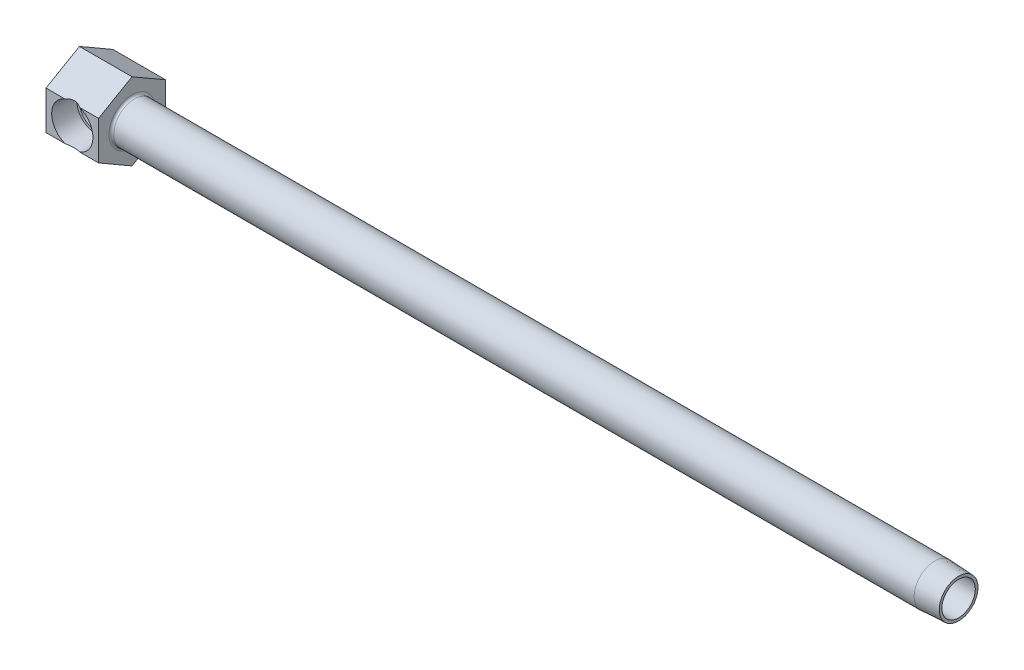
ISO-10303-21;
HEADER;
FILE_DESCRIPTION(('STEP AP214'),'2;1');
FILE_NAME('part.step','',(''),(''),'','','');
FILE_SCHEMA(('AUTOMOTIVE_DESIGN { 1 0 10303 214 1 1 1 1 }'));
ENDSEC;
DATA;
#1=APPLICATION_CONTEXT('core data for automotive mechanical design processes');
#2=APPLICATION_PROTOCOL_DEFINITION('international standard','automotive_design',2000,#1);
#3=PRODUCT_CONTEXT('',#1,'mechanical');
#4=PRODUCT('Part','Part','',(#3));
#5=PRODUCT_RELATED_PRODUCT_CATEGORY('part','',(#4));
#6=PRODUCT_DEFINITION_FORMATION('','',#4);
#7=PRODUCT_DEFINITION_CONTEXT('part definition',#1,'design');
#8=PRODUCT_DEFINITION('design','',#6,#7);
#9=PRODUCT_DEFINITION_SHAPE('','',#8);
#10=(LENGTH_UNIT() NAMED_UNIT(*) SI_UNIT(.MILLI.,.METRE.));
#11=(NAMED_UNIT(*) PLANE_ANGLE_UNIT() SI_UNIT($,.RADIAN.));
#12=(NAMED_UNIT(*) SI_UNIT($,.STERADIAN.) SOLID_ANGLE_UNIT());
#13=UNCERTAINTY_MEASURE_WITH_UNIT(LENGTH_MEASURE(1.E-05),#10,'distance_accuracy_value','');
#14=(GEOMETRIC_REPRESENTATION_CONTEXT(3) GLOBAL_UNCERTAINTY_ASSIGNED_CONTEXT((#13)) GLOBAL_UNIT_ASSIGNED_CONTEXT((#10,
#11,#12)) REPRESENTATION_CONTEXT('',''));
#15=CARTESIAN_POINT('',(0.,0.,0.));
#16=DIRECTION('',(0.,0.,1.));
#17=DIRECTION('',(1.,0.,0.));
#18=AXIS2_PLACEMENT_3D('',#15,#16,#17);
#19=CARTESIAN_POINT('',(63.5,0.,11.1125));
#20=DIRECTION('',(-1.,0.,0.));
#21=DIRECTION('',(0.,0.,1.));
#22=AXIS2_PLACEMENT_3D('',#19,#20,#21);
#23=CYLINDRICAL_SURFACE('',#22,6.858);
#24=CARTESIAN_POINT('',(18.2499,0.,11.1125));
#25=DIRECTION('',(-1.,0.,0.));
#26=DIRECTION('',(0.,-1.,0.));
#27=AXIS2_PLACEMENT_3D('',#24,#25,#26);
#28=CIRCLE('',#27,6.858);
#29=CARTESIAN_POINT('',(18.2499,-6.858,11.1125));
#30=VERTEX_POINT('',#29);
#31=EDGE_CURVE('E22',#30,#30,#28,.F.);
#32=ORIENTED_EDGE('',*,*,#31,.T.);
#33=EDGE_LOOP('',(#32));
#34=FACE_BOUND('',#33,.T.);
#35=CARTESIAN_POINT('',(284.1752,0.,11.1125));
#36=DIRECTION('',(1.,0.,0.));
#37=DIRECTION('',(0.,0.,-1.));
#38=AXIS2_PLACEMENT_3D('',#35,#36,#37);
#39=CIRCLE('',#38,6.858);
#40=CARTESIAN_POINT('',(284.1752,0.,4.2545));
#41=VERTEX_POINT('',#40);
#42=EDGE_CURVE('E156',#41,#41,#39,.T.);
#43=ORIENTED_EDGE('',*,*,#42,.F.);
#44=EDGE_LOOP('',(#43));
#45=FACE_BOUND('',#44,.T.);
#46=ADVANCED_FACE('F15',(#34,#45),#23,.T.);
#47=CARTESIAN_POINT('',(8.7376,0.,22.225));
#48=DIRECTION('',(0.,0.,1.));
#49=DIRECTION('',(1.,0.,0.));
#50=AXIS2_PLACEMENT_3D('',#47,#48,#49);
#51=CONICAL_SURFACE('',#50,6.858,0.0523598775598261);
#52=CARTESIAN_POINT('',(8.7376,-0.680996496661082,34.5170205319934));
#53=DIRECTION('',(0.,-0.866025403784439,-0.5));
#54=DIRECTION('',(0.,-0.5,0.866025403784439));
#55=AXIS2_PLACEMENT_3D('',#52,#53,#54);
#56=ELLIPSE('',#55,15.0043949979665,7.47122554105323);
#57=CARTESIAN_POINT('',(11.1603281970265,6.4158048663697,22.225));
#58=VERTEX_POINT('',#57);
#59=CARTESIAN_POINT('',(6.3148718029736,6.4158048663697,22.225));
#60=VERTEX_POINT('',#59);
#61=EDGE_CURVE('E232',#58,#60,#56,.F.);
#62=ORIENTED_EDGE('',*,*,#61,.T.);
#63=CARTESIAN_POINT('',(8.7376,0.,22.225));
#64=DIRECTION('',(0.,0.,-1.));
#65=DIRECTION('',(-1.,0.,0.));
#66=AXIS2_PLACEMENT_3D('',#63,#64,#65);
#67=CIRCLE('',#66,6.858);
#68=CARTESIAN_POINT('',(6.31487180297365,-6.41580486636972,22.225));
#69=VERTEX_POINT('',#68);
#70=EDGE_CURVE('E36',#69,#60,#67,.T.);
#71=ORIENTED_EDGE('',*,*,#70,.F.);
#72=CARTESIAN_POINT('',(8.7376,0.680996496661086,34.5170205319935));
#73=DIRECTION('',(0.,0.866025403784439,-0.5));
#74=DIRECTION('',(0.,0.5,0.866025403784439));
#75=AXIS2_PLACEMENT_3D('',#72,#73,#74);
#76=ELLIPSE('',#75,15.0043949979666,7.47122554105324);
#77=CARTESIAN_POINT('',(11.1603281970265,-6.4158048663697,22.225));
#78=VERTEX_POINT('',#77);
#79=EDGE_CURVE('E10',#69,#78,#76,.F.);
#80=ORIENTED_EDGE('',*,*,#79,.T.);
#81=EDGE_CURVE('E249',#58,#78,#67,.T.);
#82=ORIENTED_EDGE('',*,*,#81,.F.);
#83=EDGE_LOOP('',(#62,#71,#80,#82));
#84=FACE_BOUND('',#83,.T.);
#85=CARTESIAN_POINT('',(8.7376,0.,14.3002));
#86=DIRECTION('',(0.,0.,-1.));
#87=DIRECTION('',(-1.,0.,0.));
#88=AXIS2_PLACEMENT_3D('',#85,#86,#87);
#89=CIRCLE('',#88,6.44267883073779);
#90=CARTESIAN_POINT('',(13.3057672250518,-4.54312213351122,14.3002));
#91=VERTEX_POINT('',#90);
#92=CARTESIAN_POINT('',(13.3057672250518,4.54312213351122,14.3002));
#93=VERTEX_POINT('',#92);
#94=EDGE_CURVE('E251',#91,#93,#89,.T.);
#95=ORIENTED_EDGE('',*,*,#94,.T.);
#96=CARTESIAN_POINT('',(13.3056128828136,4.54326245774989,14.3));
#97=CARTESIAN_POINT('',(13.4050037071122,4.45290836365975,14.4287190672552));
#98=CARTESIAN_POINT('',(13.5038252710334,4.35690222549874,14.5539811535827));
#99=CARTESIAN_POINT('',(13.6989301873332,4.15324987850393,14.7972290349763));
#100=CARTESIAN_POINT('',(13.7952093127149,4.04558563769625,14.9152031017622));
#101=CARTESIAN_POINT('',(13.9843700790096,3.81752411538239,15.1441485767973));
#102=CARTESIAN_POINT('',(14.0772125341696,3.69701926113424,15.25504596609));
#103=CARTESIAN_POINT('',(14.2568464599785,3.44414434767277,15.4675620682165));
#104=CARTESIAN_POINT('',(14.3436418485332,3.31178210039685,15.5691868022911));
#105=CARTESIAN_POINT('',(14.5527686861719,2.962976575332,15.8122617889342));
#106=CARTESIAN_POINT('',(14.6701286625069,2.73858307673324,15.9469651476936));
#107=CARTESIAN_POINT('',(14.8276174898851,2.38307262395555,16.1264780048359));
#108=CARTESIAN_POINT('',(14.8769849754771,2.2615363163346,16.1825173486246));
#109=CARTESIAN_POINT('',(14.9687772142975,2.0125151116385,16.2864098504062));
#110=CARTESIAN_POINT('',(15.0112056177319,1.88503338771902,16.3342673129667));
#111=CARTESIAN_POINT('',(15.088733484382,1.6232487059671,16.4215218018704));
#112=CARTESIAN_POINT('',(15.1237419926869,1.48888366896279,16.4608139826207));
#113=CARTESIAN_POINT('',(15.1849785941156,1.21573970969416,16.5294343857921));
#114=CARTESIAN_POINT('',(15.2112114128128,1.0769632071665,16.5587679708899));
#115=CARTESIAN_POINT('',(15.2542466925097,0.796159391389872,16.6068431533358));
#116=CARTESIAN_POINT('',(15.2710505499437,0.654132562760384,16.6255863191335));
#117=CARTESIAN_POINT('',(15.2947665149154,0.368243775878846,16.6520290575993));
#118=CARTESIAN_POINT('',(15.3016803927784,0.22438215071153,16.6597306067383));
#119=CARTESIAN_POINT('',(15.3051381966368,-0.0413792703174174,16.6635827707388));
#120=CARTESIAN_POINT('',(15.3031178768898,-0.163241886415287,16.6613326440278));
#121=CARTESIAN_POINT('',(15.2919140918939,-0.406265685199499,16.6488476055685));
#122=CARTESIAN_POINT('',(15.282728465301,-0.527426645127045,16.6386102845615));
#123=CARTESIAN_POINT('',(15.2573805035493,-0.768029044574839,16.6103343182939));
#124=CARTESIAN_POINT('',(15.2412218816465,-0.88747136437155,16.5922998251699));
#125=CARTESIAN_POINT('',(15.2022471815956,-1.1238947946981,16.5487418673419));
#126=CARTESIAN_POINT('',(15.1794285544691,-1.24087494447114,16.5232155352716));
#127=CARTESIAN_POINT('',(15.1030013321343,-1.58064044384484,16.4375716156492));
#128=CARTESIAN_POINT('',(15.0406598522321,-1.79907617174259,16.3675454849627));
#129=CARTESIAN_POINT('',(14.8959772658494,-2.2198653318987,16.2041288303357));
#130=CARTESIAN_POINT('',(14.8136249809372,-2.42220969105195,16.1107252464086));
#131=CARTESIAN_POINT('',(14.6581620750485,-2.75475802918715,15.9330467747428));
#132=CARTESIAN_POINT('',(14.588877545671,-2.88934500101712,15.8534887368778));
#133=CARTESIAN_POINT('',(14.4433958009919,-3.14876465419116,15.6853070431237));
#134=CARTESIAN_POINT('',(14.3671982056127,-3.27359679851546,15.5966828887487));
#135=CARTESIAN_POINT('',(14.2091096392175,-3.51355050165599,15.4112660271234));
#136=CARTESIAN_POINT('',(14.1272094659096,-3.62865566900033,15.3144600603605));
#137=CARTESIAN_POINT('',(13.9591121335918,-3.84892561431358,15.1136697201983));
#138=CARTESIAN_POINT('',(13.8729164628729,-3.95409379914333,15.0096878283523));
#139=CARTESIAN_POINT('',(13.7069469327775,-4.14374167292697,14.806812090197));
#140=CARTESIAN_POINT('',(13.62749258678,-4.22922772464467,14.7085925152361));
#141=CARTESIAN_POINT('',(13.4673498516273,-4.39212627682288,14.5076746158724));
#142=CARTESIAN_POINT('',(13.386669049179,-4.46957495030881,14.404999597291));
#143=CARTESIAN_POINT('',(13.3056128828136,-4.54326245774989,14.3));
#144=B_SPLINE_CURVE_WITH_KNOTS('',3,(#96,#97,#98,#99,#100,#101,#102,#103,#104,#105,#106,#107,
#108,#109,#110,#111,#112,#113,#114,#115,#116,#117,#118,#119,#120,#121,#122,#123,#124,#125,#126,
#127,#128,#129,#130,#131,#132,#133,#134,#135,#136,#137,#138,#139,#140,#141,#142,#143),
.UNSPECIFIED.,.F.,.F.,(4,2,2,2,2,2,2,2,2,2,2,2,2,2,2,2,2,2,2,2,2,2,2,4),(0.,0.55807217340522,
1.11702021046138,1.68108674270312,2.24478434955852,3.10140634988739,3.52893103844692,
3.95623010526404,4.38849766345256,4.82053207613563,5.25250248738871,5.68439556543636,
6.04963287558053,6.41498039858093,6.78013360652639,7.14542675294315,7.85550743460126,
8.56598569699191,9.07835413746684,9.59075076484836,10.1039943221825,10.6170612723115,
11.0743952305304,11.5295724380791),.UNSPECIFIED.);
#145=EDGE_CURVE('E130',#93,#91,#144,.T.);
#146=ORIENTED_EDGE('',*,*,#145,.T.);
#147=EDGE_LOOP('',(#95,#146));
#148=FACE_BOUND('',#147,.T.);
#149=ADVANCED_FACE('F138',(#84,#148),#51,.F.);
#150=CARTESIAN_POINT('',(15.1802788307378,0.,14.3002));
#151=DIRECTION('',(0.,0.,1.));
#152=DIRECTION('',(1.,0.,0.));
#153=AXIS2_PLACEMENT_3D('',#150,#151,#152);
#154=PLANE('',#153);
#155=ORIENTED_EDGE('',*,*,#94,.F.);
#156=DIRECTION('',(1.,0.,0.));
#157=VECTOR('',#156,1.);
#158=CARTESIAN_POINT('',(65.6255637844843,-4.54312213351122,14.3002));
#159=LINE('',#158,#157);
#160=CARTESIAN_POINT('',(11.9253,-4.54312213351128,14.3002));
#161=VERTEX_POINT('',#160);
#162=EDGE_CURVE('E128',#91,#161,#159,.F.);
#163=ORIENTED_EDGE('',*,*,#162,.T.);
#164=CARTESIAN_POINT('',(8.7376,0.,14.3002));
#165=DIRECTION('',(0.,0.,-1.));
#166=DIRECTION('',(-1.,0.,0.));
#167=AXIS2_PLACEMENT_3D('',#164,#165,#166);
#168=CIRCLE('',#167,5.5499);
#169=CARTESIAN_POINT('',(11.9253,4.54312213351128,14.3002));
#170=VERTEX_POINT('',#169);
#171=EDGE_CURVE('E120',#161,#170,#168,.T.);
#172=ORIENTED_EDGE('',*,*,#171,.T.);
#173=DIRECTION('',(1.,0.,0.));
#174=VECTOR('',#173,1.);
#175=CARTESIAN_POINT('',(65.6255637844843,4.54312213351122,14.3002));
#176=LINE('',#175,#174);
#177=EDGE_CURVE('E123',#170,#93,#176,.T.);
#178=ORIENTED_EDGE('',*,*,#177,.T.);
#179=EDGE_LOOP('',(#155,#163,#172,#178));
#180=FACE_BOUND('',#179,.T.);
#181=ADVANCED_FACE('F181',(#180),#154,.T.);
#182=CARTESIAN_POINT('',(8.7376,0.,27.6280516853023));
#183=DIRECTION('',(0.,0.,-1.));
#184=DIRECTION('',(-1.,0.,0.));
#185=AXIS2_PLACEMENT_3D('',#182,#183,#184);
#186=CYLINDRICAL_SURFACE('',#185,5.5499);
#187=ORIENTED_EDGE('',*,*,#171,.F.);
#188=CARTESIAN_POINT('',(8.7376,0.,11.1125));
#189=DIRECTION('',(0.707106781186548,0.,-0.707106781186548));
#190=DIRECTION('',(-0.707106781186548,0.,-0.707106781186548));
#191=AXIS2_PLACEMENT_3D('',#188,#189,#190);
#192=ELLIPSE('',#191,7.84874384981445,5.5499);
#193=CARTESIAN_POINT('',(8.7376,-5.5499,11.1125));
#194=VERTEX_POINT('',#193);
#195=EDGE_CURVE('E109',#161,#194,#192,.T.);
#196=ORIENTED_EDGE('',*,*,#195,.T.);
#197=CARTESIAN_POINT('',(8.7376,0.,11.1125));
#198=DIRECTION('',(-0.707106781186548,0.,-0.707106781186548));
#199=DIRECTION('',(0.707106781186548,0.,-0.707106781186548));
#200=AXIS2_PLACEMENT_3D('',#197,#198,#199);
#201=ELLIPSE('',#200,7.84874384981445,5.5499);
#202=CARTESIAN_POINT('',(13.4708637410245,-2.89786203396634,6.37923625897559));
#203=VERTEX_POINT('',#202);
#204=EDGE_CURVE('E104',#194,#203,#201,.F.);
#205=ORIENTED_EDGE('',*,*,#204,.T.);
#206=CARTESIAN_POINT('',(8.7376,0.,6.37923625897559));
#207=DIRECTION('',(0.,0.,-1.));
#208=DIRECTION('',(-1.,0.,0.));
#209=AXIS2_PLACEMENT_3D('',#206,#207,#208);
#210=CIRCLE('',#209,5.5499);
#211=CARTESIAN_POINT('',(13.4708637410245,2.89786203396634,6.37923625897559));
#212=VERTEX_POINT('',#211);
#213=EDGE_CURVE('E136',#203,#212,#210,.T.);
#214=ORIENTED_EDGE('',*,*,#213,.T.);
#215=CARTESIAN_POINT('',(8.7376,5.5499,11.1125));
#216=VERTEX_POINT('',#215);
#217=EDGE_CURVE('E29',#212,#216,#201,.F.);
#218=ORIENTED_EDGE('',*,*,#217,.T.);
#219=EDGE_CURVE('E121',#216,#170,#192,.T.);
#220=ORIENTED_EDGE('',*,*,#219,.T.);
#221=EDGE_LOOP('',(#187,#196,#205,#214,#218,#220));
#222=FACE_BOUND('',#221,.T.);
#223=ADVANCED_FACE('F117',(#222),#186,.F.);
#224=CARTESIAN_POINT('',(8.7376,0.,6.37923625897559));
#225=DIRECTION('',(0.,0.,1.));
#226=DIRECTION('',(1.,0.,0.));
#227=AXIS2_PLACEMENT_3D('',#224,#225,#226);
#228=CONICAL_SURFACE('',#227,5.5499,1.04719755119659);
#229=CARTESIAN_POINT('',(8.7376,0.,3.175));
#230=VERTEX_POINT('',#229);
#231=VERTEX_LOOP('',#230);
#232=FACE_BOUND('',#231,.T.);
#233=ORIENTED_EDGE('',*,*,#213,.F.);
#234=CARTESIAN_POINT('',(13.4710699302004,-2.89818868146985,6.37943625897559));
#235=CARTESIAN_POINT('',(13.420685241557,-2.8185279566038,6.33063423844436));
#236=CARTESIAN_POINT('',(13.3737513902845,-2.73601453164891,6.2828976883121));
#237=CARTESIAN_POINT('',(13.2869939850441,-2.56583570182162,6.19038737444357));
#238=CARTESIAN_POINT('',(13.2471660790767,-2.47817349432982,6.14561180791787));
#239=CARTESIAN_POINT('',(13.1751547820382,-2.29911606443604,6.06025322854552));
#240=CARTESIAN_POINT('',(13.1428940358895,-2.20777091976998,6.01963042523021));
#241=CARTESIAN_POINT('',(13.0851463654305,-2.02119544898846,5.94274790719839));
#242=CARTESIAN_POINT('',(13.0596596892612,-1.92596498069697,5.90648835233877));
#243=CARTESIAN_POINT('',(13.0148514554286,-1.73255643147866,5.83897057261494));
#244=CARTESIAN_POINT('',(12.9955185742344,-1.63438413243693,5.80770321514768));
#245=CARTESIAN_POINT('',(12.9620830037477,-1.4356334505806,5.75050007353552));
#246=CARTESIAN_POINT('',(12.9479806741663,-1.33505490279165,5.72456465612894));
#247=CARTESIAN_POINT('',(12.9240526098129,-1.13183172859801,5.67823452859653));
#248=CARTESIAN_POINT('',(12.9142392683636,-1.0291819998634,5.65785593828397));
#249=CARTESIAN_POINT('',(12.8981074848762,-0.822623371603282,5.62290462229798));
#250=CARTESIAN_POINT('',(12.891789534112,-0.718714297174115,5.60833271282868));
#251=CARTESIAN_POINT('',(12.8810293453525,-0.489671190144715,5.58281999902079));
#252=CARTESIAN_POINT('',(12.8771967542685,-0.364365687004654,5.57314917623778));
#253=CARTESIAN_POINT('',(12.8729275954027,-0.113319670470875,5.56233429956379));
#254=CARTESIAN_POINT('',(12.8724915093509,0.0124209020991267,5.56119145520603));
#255=CARTESIAN_POINT('',(12.874939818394,0.263686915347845,5.567443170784));
#256=CARTESIAN_POINT('',(12.8778249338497,0.389212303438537,5.57483958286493));
#257=CARTESIAN_POINT('',(12.8874191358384,0.639322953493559,5.59811647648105));
#258=CARTESIAN_POINT('',(12.8941278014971,0.763908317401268,5.61399602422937));
#259=CARTESIAN_POINT('',(12.9116197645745,1.00072761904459,5.65236645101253));
#260=CARTESIAN_POINT('',(12.9220027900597,1.11310193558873,5.6741708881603));
#261=CARTESIAN_POINT('',(12.9479188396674,1.33574469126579,5.72453194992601));
#262=CARTESIAN_POINT('',(12.9634519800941,1.44601308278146,5.75308872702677));
#263=CARTESIAN_POINT('',(13.00082798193,1.66326683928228,5.81649299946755));
#264=CARTESIAN_POINT('',(13.022650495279,1.77026157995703,5.85132007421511));
#265=CARTESIAN_POINT('',(13.0737132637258,1.98033019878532,5.92673676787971));
#266=CARTESIAN_POINT('',(13.1029503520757,2.08340572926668,5.96732392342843));
#267=CARTESIAN_POINT('',(13.1785970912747,2.31167706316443,6.06504898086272));
#268=CARTESIAN_POINT('',(13.2275080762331,2.43541928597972,6.12371071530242));
#269=CARTESIAN_POINT('',(13.3111431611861,2.61414296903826,6.21635789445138));
#270=CARTESIAN_POINT('',(13.3408272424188,2.67271819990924,6.24810824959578));
#271=CARTESIAN_POINT('',(13.4034989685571,2.78735967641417,6.31288069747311));
#272=CARTESIAN_POINT('',(13.4364871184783,2.8434255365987,6.34590298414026));
#273=CARTESIAN_POINT('',(13.4710699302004,2.89818868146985,6.37943625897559));
#274=B_SPLINE_CURVE_WITH_KNOTS('',3,(#234,#235,#236,#237,#238,#239,#240,#241,#242,#243,#244,
#245,#246,#247,#248,#249,#250,#251,#252,#253,#254,#255,#256,#257,#258,#259,#260,#261,#262,#263,
#264,#265,#266,#267,#268,#269,#270,#271,#272,#273),.UNSPECIFIED.,.F.,.F.,(4,2,2,2,2,2,2,2,2,2,2,
2,2,2,2,2,2,2,2,4),(0.,0.318348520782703,0.636501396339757,0.951244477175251,1.26599908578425,
1.58017112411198,1.89436476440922,2.20946038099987,2.52460027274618,2.90145665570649,
3.27836648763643,3.65535808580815,4.03230819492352,4.37682355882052,4.72134670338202,
5.06476748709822,5.40804184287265,5.84309066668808,6.06180090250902,6.28054461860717),.UNSPECIFIED.);
#275=EDGE_CURVE('E111',#203,#212,#274,.T.);
#276=ORIENTED_EDGE('',*,*,#275,.T.);
#277=EDGE_LOOP('',(#233,#276));
#278=FACE_BOUND('',#277,.T.);
#279=ADVANCED_FACE('F148',(#232,#278),#228,.F.);
#280=CARTESIAN_POINT('',(17.4625,12.8316097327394,11.1125));
#281=DIRECTION('',(0.,-0.866025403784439,-0.5));
#282=DIRECTION('',(0.,0.5,-0.866025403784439));
#283=AXIS2_PLACEMENT_3D('',#280,#281,#282);
#284=PLANE('',#283);
#285=ORIENTED_EDGE('',*,*,#61,.F.);
#286=DIRECTION('',(-1.,0.,0.));
#287=VECTOR('',#286,1.);
#288=CARTESIAN_POINT('',(17.4625,6.4158048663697,22.225));
#289=LINE('',#288,#287);
#290=CARTESIAN_POINT('',(17.4625,6.4158048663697,22.225));
#291=VERTEX_POINT('',#290);
#292=EDGE_CURVE('E202',#291,#58,#289,.T.);
#293=ORIENTED_EDGE('',*,*,#292,.F.);
#294=DIRECTION('',(0.,-0.5,0.866025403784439));
#295=VECTOR('',#294,1.);
#296=CARTESIAN_POINT('',(17.4625,12.8316097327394,11.1125));
#297=LINE('',#296,#295);
#298=CARTESIAN_POINT('',(17.4625,12.8316097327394,11.1125));
#299=VERTEX_POINT('',#298);
#300=EDGE_CURVE('E222',#299,#291,#297,.T.);
#301=ORIENTED_EDGE('',*,*,#300,.F.);
#302=DIRECTION('',(-1.,0.,0.));
#303=VECTOR('',#302,1.);
#304=CARTESIAN_POINT('',(17.4625,12.8316097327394,11.1125));
#305=LINE('',#304,#303);
#306=CARTESIAN_POINT('',(0.,12.8316097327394,11.1125));
#307=VERTEX_POINT('',#306);
#308=EDGE_CURVE('E199',#299,#307,#305,.T.);
#309=ORIENTED_EDGE('',*,*,#308,.T.);
#310=DIRECTION('',(0.,-0.5,0.866025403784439));
#311=VECTOR('',#310,1.);
#312=CARTESIAN_POINT('',(0.,12.8316097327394,11.1125));
#313=LINE('',#312,#311);
#314=CARTESIAN_POINT('',(0.,6.4158048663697,22.225));
#315=VERTEX_POINT('',#314);
#316=EDGE_CURVE('E239',#307,#315,#313,.T.);
#317=ORIENTED_EDGE('',*,*,#316,.T.);
#318=EDGE_CURVE('E205',#60,#315,#289,.T.);
#319=ORIENTED_EDGE('',*,*,#318,.F.);
#320=EDGE_LOOP('',(#285,#293,#301,#309,#317,#319));
#321=FACE_BOUND('',#320,.T.);
#322=ADVANCED_FACE('F256',(#321),#284,.F.);
#323=CARTESIAN_POINT('',(17.4625,6.4158048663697,22.225));
#324=DIRECTION('',(0.,0.,-1.));
#325=DIRECTION('',(0.,1.,0.));
#326=AXIS2_PLACEMENT_3D('',#323,#324,#325);
#327=PLANE('',#326);
#328=ORIENTED_EDGE('',*,*,#70,.T.);
#329=ORIENTED_EDGE('',*,*,#318,.T.);
#330=DIRECTION('',(0.,-1.,0.));
#331=VECTOR('',#330,1.);
#332=CARTESIAN_POINT('',(0.,6.4158048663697,22.225));
#333=LINE('',#332,#331);
#334=CARTESIAN_POINT('',(0.,-6.41580486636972,22.225));
#335=VERTEX_POINT('',#334);
#336=EDGE_CURVE('E235',#315,#335,#333,.T.);
#337=ORIENTED_EDGE('',*,*,#336,.T.);
#338=DIRECTION('',(-1.,0.,0.));
#339=VECTOR('',#338,1.);
#340=CARTESIAN_POINT('',(17.4625,-6.41580486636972,22.225));
#341=LINE('',#340,#339);
#342=EDGE_CURVE('E209',#69,#335,#341,.T.);
#343=ORIENTED_EDGE('',*,*,#342,.F.);
#344=EDGE_LOOP('',(#328,#329,#337,#343));
#345=FACE_BOUND('',#344,.T.);
#346=ADVANCED_FACE('F263',(#345),#327,.F.);
#347=ORIENTED_EDGE('',*,*,#81,.T.);
#348=CARTESIAN_POINT('',(17.4625,-6.41580486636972,22.225));
#349=VERTEX_POINT('',#348);
#350=EDGE_CURVE('E206',#349,#78,#341,.T.);
#351=ORIENTED_EDGE('',*,*,#350,.F.);
#352=DIRECTION('',(0.,-1.,0.));
#353=VECTOR('',#352,1.);
#354=CARTESIAN_POINT('',(17.4625,6.4158048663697,22.225));
#355=LINE('',#354,#353);
#356=EDGE_CURVE('E220',#291,#349,#355,.T.);
#357=ORIENTED_EDGE('',*,*,#356,.F.);
#358=ORIENTED_EDGE('',*,*,#292,.T.);
#359=EDGE_LOOP('',(#347,#351,#357,#358));
#360=FACE_BOUND('',#359,.T.);
#361=ADVANCED_FACE('F287',(#360),#327,.F.);
#362=CARTESIAN_POINT('',(17.4625,-6.41580486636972,22.225));
#363=DIRECTION('',(0.,0.866025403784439,-0.5));
#364=DIRECTION('',(0.,0.5,0.866025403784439));
#365=AXIS2_PLACEMENT_3D('',#362,#363,#364);
#366=PLANE('',#365);
#367=ORIENTED_EDGE('',*,*,#79,.F.);
#368=ORIENTED_EDGE('',*,*,#342,.T.);
#369=DIRECTION('',(0.,-0.5,-0.866025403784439));
#370=VECTOR('',#369,1.);
#371=CARTESIAN_POINT('',(0.,-6.41580486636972,22.225));
#372=LINE('',#371,#370);
#373=CARTESIAN_POINT('',(0.,-12.8316097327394,11.1125));
#374=VERTEX_POINT('',#373);
#375=EDGE_CURVE('E218',#335,#374,#372,.T.);
#376=ORIENTED_EDGE('',*,*,#375,.T.);
#377=DIRECTION('',(-1.,0.,0.));
#378=VECTOR('',#377,1.);
#379=CARTESIAN_POINT('',(17.4625,-12.8316097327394,11.1125));
#380=LINE('',#379,#378);
#381=CARTESIAN_POINT('',(17.4625,-12.8316097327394,11.1125));
#382=VERTEX_POINT('',#381);
#383=EDGE_CURVE('E210',#382,#374,#380,.T.);
#384=ORIENTED_EDGE('',*,*,#383,.F.);
#385=DIRECTION('',(0.,-0.5,-0.866025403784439));
#386=VECTOR('',#385,1.);
#387=CARTESIAN_POINT('',(17.4625,-6.41580486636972,22.225));
#388=LINE('',#387,#386);
#389=EDGE_CURVE('E213',#349,#382,#388,.T.);
#390=ORIENTED_EDGE('',*,*,#389,.F.);
#391=ORIENTED_EDGE('',*,*,#350,.T.);
#392=EDGE_LOOP('',(#367,#368,#376,#384,#390,#391));
#393=FACE_BOUND('',#392,.T.);
#394=ADVANCED_FACE('F283',(#393),#366,.F.);
#395=CARTESIAN_POINT('',(17.4625,-12.8316097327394,11.1125));
#396=DIRECTION('',(0.,0.866025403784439,0.5));
#397=DIRECTION('',(0.,-0.5,0.866025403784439));
#398=AXIS2_PLACEMENT_3D('',#395,#396,#397);
#399=PLANE('',#398);
#400=DIRECTION('',(0.,0.5,-0.866025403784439));
#401=VECTOR('',#400,1.);
#402=CARTESIAN_POINT('',(0.,-12.8316097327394,11.1125));
#403=LINE('',#402,#401);
#404=CARTESIAN_POINT('',(0.,-6.41580486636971,0.));
#405=VERTEX_POINT('',#404);
#406=EDGE_CURVE('E227',#374,#405,#403,.T.);
#407=ORIENTED_EDGE('',*,*,#406,.T.);
#408=DIRECTION('',(-1.,0.,0.));
#409=VECTOR('',#408,1.);
#410=CARTESIAN_POINT('',(17.4625,-6.41580486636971,0.));
#411=LINE('',#410,#409);
#412=CARTESIAN_POINT('',(17.4625,-6.41580486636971,0.));
#413=VERTEX_POINT('',#412);
#414=EDGE_CURVE('E191',#413,#405,#411,.T.);
#415=ORIENTED_EDGE('',*,*,#414,.F.);
#416=DIRECTION('',(0.,0.5,-0.866025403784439));
#417=VECTOR('',#416,1.);
#418=CARTESIAN_POINT('',(17.4625,-12.8316097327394,11.1125));
#419=LINE('',#418,#417);
#420=EDGE_CURVE('E214',#382,#413,#419,.T.);
#421=ORIENTED_EDGE('',*,*,#420,.F.);
#422=ORIENTED_EDGE('',*,*,#383,.T.);
#423=EDGE_LOOP('',(#407,#415,#421,#422));
#424=FACE_BOUND('',#423,.T.);
#425=ADVANCED_FACE('F286',(#424),#399,.F.);
#426=CARTESIAN_POINT('',(17.4625,-6.41580486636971,0.));
#427=DIRECTION('',(0.,0.,1.));
#428=DIRECTION('',(1.,0.,0.));
#429=AXIS2_PLACEMENT_3D('',#426,#427,#428);
#430=PLANE('',#429);
#431=DIRECTION('',(0.,1.,0.));
#432=VECTOR('',#431,1.);
#433=CARTESIAN_POINT('',(0.,-6.41580486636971,0.));
#434=LINE('',#433,#432);
#435=CARTESIAN_POINT('',(0.,6.41580486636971,0.));
#436=VERTEX_POINT('',#435);
#437=EDGE_CURVE('E231',#405,#436,#434,.T.);
#438=ORIENTED_EDGE('',*,*,#437,.T.);
#439=DIRECTION('',(-1.,0.,0.));
#440=VECTOR('',#439,1.);
#441=CARTESIAN_POINT('',(17.4625,6.41580486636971,0.));
#442=LINE('',#441,#440);
#443=CARTESIAN_POINT('',(17.4625,6.41580486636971,0.));
#444=VERTEX_POINT('',#443);
#445=EDGE_CURVE('E196',#444,#436,#442,.T.);
#446=ORIENTED_EDGE('',*,*,#445,.F.);
#447=DIRECTION('',(0.,1.,0.));
#448=VECTOR('',#447,1.);
#449=CARTESIAN_POINT('',(17.4625,-6.41580486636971,0.));
#450=LINE('',#449,#448);
#451=EDGE_CURVE('E217',#413,#444,#450,.T.);
#452=ORIENTED_EDGE('',*,*,#451,.F.);
#453=ORIENTED_EDGE('',*,*,#414,.T.);
#454=EDGE_LOOP('',(#438,#446,#452,#453));
#455=FACE_BOUND('',#454,.T.);
#456=ADVANCED_FACE('F294',(#455),#430,.F.);
#457=CARTESIAN_POINT('',(17.4625,6.4158048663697,0.));
#458=DIRECTION('',(0.,-0.866025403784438,0.5));
#459=DIRECTION('',(0.,-0.5,-0.866025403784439));
#460=AXIS2_PLACEMENT_3D('',#457,#458,#459);
#461=PLANE('',#460);
#462=DIRECTION('',(0.,0.5,0.866025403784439));
#463=VECTOR('',#462,1.);
#464=CARTESIAN_POINT('',(0.,6.4158048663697,0.));
#465=LINE('',#464,#463);
#466=EDGE_CURVE('E243',#436,#307,#465,.T.);
#467=ORIENTED_EDGE('',*,*,#466,.T.);
#468=ORIENTED_EDGE('',*,*,#308,.F.);
#469=DIRECTION('',(0.,0.5,0.866025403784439));
#470=VECTOR('',#469,1.);
#471=CARTESIAN_POINT('',(17.4625,6.4158048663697,0.));
#472=LINE('',#471,#470);
#473=EDGE_CURVE('E224',#444,#299,#472,.T.);
#474=ORIENTED_EDGE('',*,*,#473,.F.);
#475=ORIENTED_EDGE('',*,*,#445,.T.);
#476=EDGE_LOOP('',(#467,#468,#474,#475));
#477=FACE_BOUND('',#476,.T.);
#478=ADVANCED_FACE('F281',(#477),#461,.F.);
#479=CARTESIAN_POINT('',(17.4625,-19.2474145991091,22.225));
#480=DIRECTION('',(-1.,0.,0.));
#481=DIRECTION('',(0.,-1.,0.));
#482=AXIS2_PLACEMENT_3D('',#479,#480,#481);
#483=PLANE('',#482);
#484=CARTESIAN_POINT('',(17.4625,0.,11.1125));
#485=DIRECTION('',(-1.,0.,0.));
#486=DIRECTION('',(0.,-1.,0.));
#487=AXIS2_PLACEMENT_3D('',#484,#485,#486);
#488=CIRCLE('',#487,7.6454);
#489=CARTESIAN_POINT('',(17.4625,-7.6454,11.1125));
#490=VERTEX_POINT('',#489);
#491=EDGE_CURVE('E189',#490,#490,#488,.T.);
#492=ORIENTED_EDGE('',*,*,#491,.T.);
#493=EDGE_LOOP('',(#492));
#494=FACE_BOUND('',#493,.T.);
#495=ORIENTED_EDGE('',*,*,#420,.T.);
#496=ORIENTED_EDGE('',*,*,#451,.T.);
#497=ORIENTED_EDGE('',*,*,#473,.T.);
#498=ORIENTED_EDGE('',*,*,#300,.T.);
#499=ORIENTED_EDGE('',*,*,#356,.T.);
#500=ORIENTED_EDGE('',*,*,#389,.T.);
#501=EDGE_LOOP('',(#495,#496,#497,#498,#499,#500));
#502=FACE_BOUND('',#501,.T.);
#503=ADVANCED_FACE('F277',(#494,#502),#483,.F.);
#504=CARTESIAN_POINT('',(0.,-19.2474145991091,22.225));
#505=DIRECTION('',(-1.,0.,0.));
#506=DIRECTION('',(0.,-1.,0.));
#507=AXIS2_PLACEMENT_3D('',#504,#505,#506);
#508=PLANE('',#507);
#509=ORIENTED_EDGE('',*,*,#406,.F.);
#510=ORIENTED_EDGE('',*,*,#375,.F.);
#511=ORIENTED_EDGE('',*,*,#336,.F.);
#512=ORIENTED_EDGE('',*,*,#316,.F.);
#513=ORIENTED_EDGE('',*,*,#466,.F.);
#514=ORIENTED_EDGE('',*,*,#437,.F.);
#515=EDGE_LOOP('',(#509,#510,#511,#512,#513,#514));
#516=FACE_BOUND('',#515,.T.);
#517=ADVANCED_FACE('F274',(#516),#508,.T.);
#518=CARTESIAN_POINT('',(18.2499,0.,11.1125));
#519=DIRECTION('',(-1.,0.,0.));
#520=DIRECTION('',(0.,-1.,0.));
#521=AXIS2_PLACEMENT_3D('',#518,#519,#520);
#522=TOROIDAL_SURFACE('',#521,7.6454,0.7874);
#523=ORIENTED_EDGE('',*,*,#31,.F.);
#524=EDGE_LOOP('',(#523));
#525=FACE_BOUND('',#524,.T.);
#526=ORIENTED_EDGE('',*,*,#491,.F.);
#527=EDGE_LOOP('',(#526));
#528=FACE_BOUND('',#527,.T.);
#529=ADVANCED_FACE('F146',(#525,#528),#522,.F.);
#530=CARTESIAN_POINT('',(65.6255637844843,0.,11.1125));
#531=DIRECTION('',(1.,0.,0.));
#532=DIRECTION('',(0.,0.,-1.));
#533=AXIS2_PLACEMENT_3D('',#530,#531,#532);
#534=CYLINDRICAL_SURFACE('',#533,5.5499);
#535=ORIENTED_EDGE('',*,*,#177,.F.);
#536=ORIENTED_EDGE('',*,*,#219,.F.);
#537=ORIENTED_EDGE('',*,*,#217,.F.);
#538=ORIENTED_EDGE('',*,*,#275,.F.);
#539=ORIENTED_EDGE('',*,*,#204,.F.);
#540=ORIENTED_EDGE('',*,*,#195,.F.);
#541=ORIENTED_EDGE('',*,*,#162,.F.);
#542=ORIENTED_EDGE('',*,*,#145,.F.);
#543=EDGE_LOOP('',(#535,#536,#537,#538,#539,#540,#541,#542));
#544=FACE_BOUND('',#543,.T.);
#545=CARTESIAN_POINT('',(292.1,0.,11.1125));
#546=DIRECTION('',(1.,0.,0.));
#547=DIRECTION('',(0.,0.,-1.));
#548=AXIS2_PLACEMENT_3D('',#545,#546,#547);
#549=CIRCLE('',#548,5.5499);
#550=CARTESIAN_POINT('',(292.1,0.,5.5626));
#551=VERTEX_POINT('',#550);
#552=EDGE_CURVE('E162',#551,#551,#549,.T.);
#553=ORIENTED_EDGE('',*,*,#552,.T.);
#554=EDGE_LOOP('',(#553));
#555=FACE_BOUND('',#554,.T.);
#556=ADVANCED_FACE('F106',(#544,#555),#534,.F.);
#557=CARTESIAN_POINT('',(292.1,0.,11.1125));
#558=DIRECTION('',(-1.,0.,0.));
#559=DIRECTION('',(0.,0.,1.));
#560=AXIS2_PLACEMENT_3D('',#557,#558,#559);
#561=CONICAL_SURFACE('',#560,6.44267883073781,0.052359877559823);
#562=ORIENTED_EDGE('',*,*,#42,.T.);
#563=EDGE_LOOP('',(#562));
#564=FACE_BOUND('',#563,.T.);
#565=CARTESIAN_POINT('',(292.1,0.,11.1125));
#566=DIRECTION('',(1.,0.,0.));
#567=DIRECTION('',(0.,0.,-1.));
#568=AXIS2_PLACEMENT_3D('',#565,#566,#567);
#569=CIRCLE('',#568,6.44267883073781);
#570=CARTESIAN_POINT('',(292.1,0.,4.66982116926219));
#571=VERTEX_POINT('',#570);
#572=EDGE_CURVE('E159',#571,#571,#569,.T.);
#573=ORIENTED_EDGE('',*,*,#572,.F.);
#574=EDGE_LOOP('',(#573));
#575=FACE_BOUND('',#574,.T.);
#576=ADVANCED_FACE('F145',(#564,#575),#561,.T.);
#577=CARTESIAN_POINT('',(292.1,0.,5.5626));
#578=DIRECTION('',(1.,0.,0.));
#579=DIRECTION('',(0.,0.,-1.));
#580=AXIS2_PLACEMENT_3D('',#577,#578,#579);
#581=PLANE('',#580);
#582=ORIENTED_EDGE('',*,*,#572,.T.);
#583=EDGE_LOOP('',(#582));
#584=FACE_BOUND('',#583,.T.);
#585=ORIENTED_EDGE('',*,*,#552,.F.);
#586=EDGE_LOOP('',(#585));
#587=FACE_BOUND('',#586,.T.);
#588=ADVANCED_FACE('F166',(#584,#587),#581,.T.);
#589=CLOSED_SHELL('',(#46,#149,#181,#223,#279,#322,#346,#361,#394,#425,#456,#478,#503,#517,#529,
#556,#576,#588));
#590=MANIFOLD_SOLID_BREP('B1',#589);
#591=ADVANCED_BREP_SHAPE_REPRESENTATION('',(#18,#590),#14);
#592=SHAPE_DEFINITION_REPRESENTATION(#9,#591);
ENDSEC;
END-ISO-10303-21;
